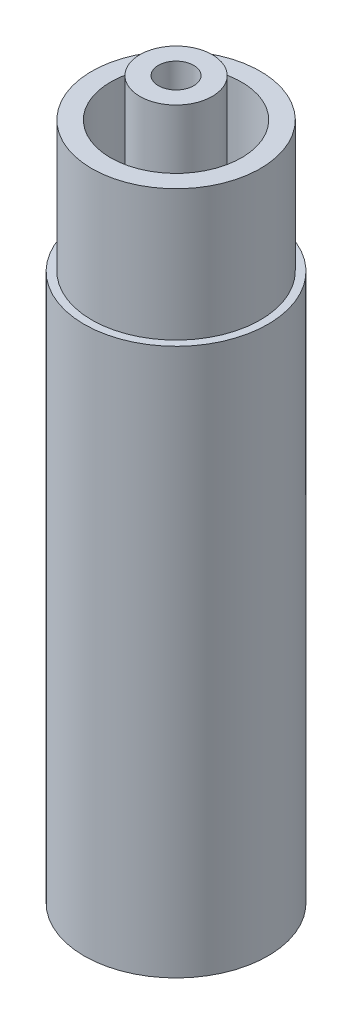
from build123d import *


with BuildPart() as part:
    # Sketch1 → Revolve1 (revolve)
    with BuildSketch(Plane.XY, mode=Mode.PRIVATE) as revolve1_sk:
        Polygon((-4.1402, 0), (-5.16255, 0), (-5.16255, 30.734), (-4.7371, 30.734), (-4.7371, 38.1), (-3.683, 38.1), (-3.683, 30.734), (-2.032, 30.734), (-2.032, 40.259), (-0.994503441, 40.259), (-0.994503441, 29.779655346), (-4.1402, 27.963486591), align=None)
    revolve(revolve1_sk.sketch.rotate(Axis((0, 0, 0), (0, -1, 0)), 270), axis=Axis((0, 0, 0), (0, -1, 0)))


with BuildPart() as body_2:
    # Sketch2 → Revolve2 (revolve)
    with BuildSketch(Plane.XY, mode=Mode.PRIVATE) as revolve2_sk:
        Polygon((0, 11.662287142), (-4.1275, 10.16), (-4.1275, 6.35), (0, 6.35), align=None)
    revolve(revolve2_sk.sketch.rotate(Axis((0, 0, 0), (0, 1, 0)), 180), axis=Axis((0, 0, 0), (0, 1, 0)))


solid = Compound([part.part, body_2.part])
